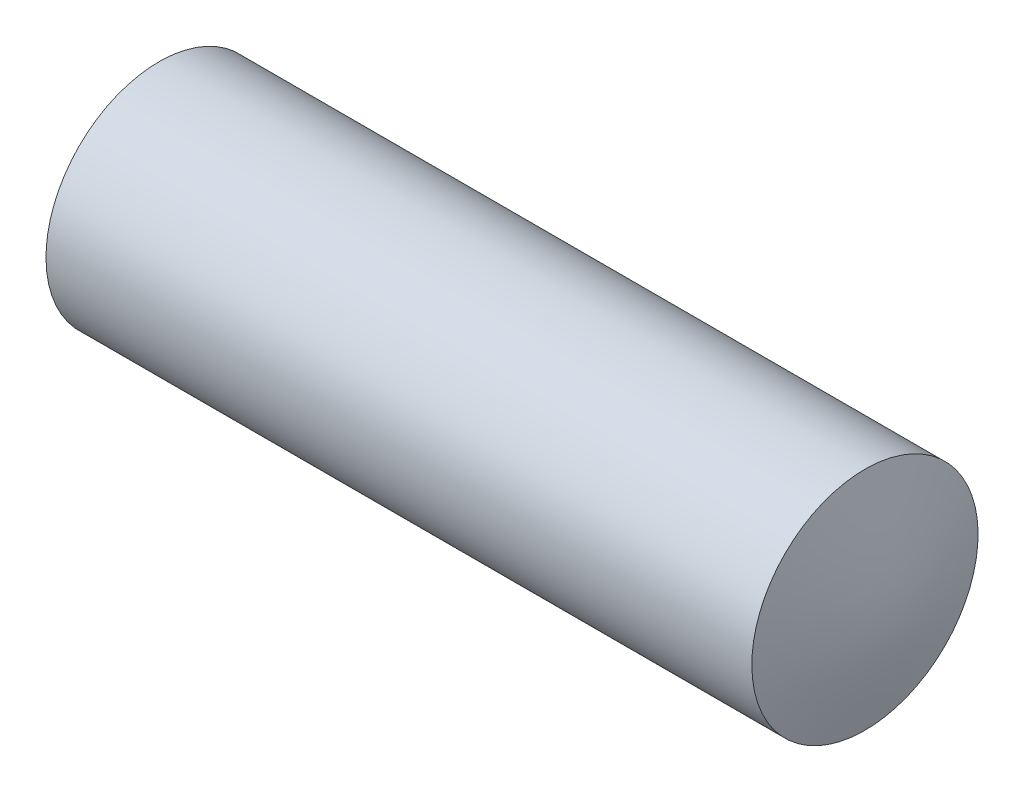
ISO-10303-21;
HEADER;
FILE_DESCRIPTION(('STEP AP214'),'2;1');
FILE_NAME('part.step','',(''),(''),'','','');
FILE_SCHEMA(('AUTOMOTIVE_DESIGN { 1 0 10303 214 1 1 1 1 }'));
ENDSEC;
DATA;
#1=APPLICATION_CONTEXT('core data for automotive mechanical design processes');
#2=APPLICATION_PROTOCOL_DEFINITION('international standard','automotive_design',2000,#1);
#3=PRODUCT_CONTEXT('',#1,'mechanical');
#4=PRODUCT('Part','Part','',(#3));
#5=PRODUCT_RELATED_PRODUCT_CATEGORY('part','',(#4));
#6=PRODUCT_DEFINITION_FORMATION('','',#4);
#7=PRODUCT_DEFINITION_CONTEXT('part definition',#1,'design');
#8=PRODUCT_DEFINITION('design','',#6,#7);
#9=PRODUCT_DEFINITION_SHAPE('','',#8);
#10=(LENGTH_UNIT() NAMED_UNIT(*) SI_UNIT(.MILLI.,.METRE.));
#11=(NAMED_UNIT(*) PLANE_ANGLE_UNIT() SI_UNIT($,.RADIAN.));
#12=(NAMED_UNIT(*) SI_UNIT($,.STERADIAN.) SOLID_ANGLE_UNIT());
#13=UNCERTAINTY_MEASURE_WITH_UNIT(LENGTH_MEASURE(1.E-05),#10,'distance_accuracy_value','');
#14=(GEOMETRIC_REPRESENTATION_CONTEXT(3) GLOBAL_UNCERTAINTY_ASSIGNED_CONTEXT((#13)) GLOBAL_UNIT_ASSIGNED_CONTEXT((#10,
#11,#12)) REPRESENTATION_CONTEXT('',''));
#15=CARTESIAN_POINT('',(0.,0.,0.));
#16=DIRECTION('',(0.,0.,1.));
#17=DIRECTION('',(1.,0.,0.));
#18=AXIS2_PLACEMENT_3D('',#15,#16,#17);
#19=CARTESIAN_POINT('',(1.9812,0.,0.));
#20=DIRECTION('',(-1.,0.,0.));
#21=DIRECTION('',(0.,0.,1.));
#22=AXIS2_PLACEMENT_3D('',#19,#20,#21);
#23=CYLINDRICAL_SURFACE('',#22,0.635);
#24=CARTESIAN_POINT('',(1.98130394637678,-9.15382352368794E-12,0.635));
#25=CARTESIAN_POINT('',(1.98130401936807,-0.0356682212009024,0.634998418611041));
#26=CARTESIAN_POINT('',(1.9813073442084,-0.0713623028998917,0.631984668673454));
#27=CARTESIAN_POINT('',(1.98130456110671,-0.141767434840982,0.620004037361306));
#28=CARTESIAN_POINT('',(1.9812984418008,-0.176477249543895,0.611029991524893));
#29=CARTESIAN_POINT('',(1.98130425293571,-0.243879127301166,0.587385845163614));
#30=CARTESIAN_POINT('',(1.98131617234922,-0.276572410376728,0.572719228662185));
#31=CARTESIAN_POINT('',(1.98134269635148,-0.339032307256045,0.538105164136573));
#32=CARTESIAN_POINT('',(1.98135730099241,-0.368798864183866,0.518157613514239));
#33=CARTESIAN_POINT('',(1.98137288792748,-0.424559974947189,0.473548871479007));
#34=CARTESIAN_POINT('',(1.98137387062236,-0.450554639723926,0.448887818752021));
#35=CARTESIAN_POINT('',(1.98136200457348,-0.498035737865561,0.395550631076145));
#36=CARTESIAN_POINT('',(1.98134915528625,-0.519521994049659,0.366874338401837));
#37=CARTESIAN_POINT('',(1.98132331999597,-0.557374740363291,0.306322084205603));
#38=CARTESIAN_POINT('',(1.98131033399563,-0.573741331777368,0.27444618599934));
#39=CARTESIAN_POINT('',(1.98130829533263,-0.600890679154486,0.208399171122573));
#40=CARTESIAN_POINT('',(1.9813192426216,-0.611673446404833,0.174228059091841));
#41=CARTESIAN_POINT('',(1.98133768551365,-0.627349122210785,0.104560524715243));
#42=CARTESIAN_POINT('',(1.98134518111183,-0.632242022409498,0.06906410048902));
#43=CARTESIAN_POINT('',(1.98135200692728,-0.635999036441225,-0.00224631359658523));
#44=CARTESIAN_POINT('',(1.9813513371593,-0.634863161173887,-0.038060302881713));
#45=CARTESIAN_POINT('',(1.98133704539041,-0.626594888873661,-0.108989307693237));
#46=CARTESIAN_POINT('',(1.98132342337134,-0.619462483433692,-0.144104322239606));
#47=CARTESIAN_POINT('',(1.9813088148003,-0.599403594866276,-0.212638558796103));
#48=CARTESIAN_POINT('',(1.98130782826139,-0.586477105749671,-0.246057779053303));
#49=CARTESIAN_POINT('',(1.98132257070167,-0.55519700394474,-0.310251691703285));
#50=CARTESIAN_POINT('',(1.98133829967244,-0.536843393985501,-0.341026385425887));
#51=CARTESIAN_POINT('',(1.98136258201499,-0.49523005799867,-0.399057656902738));
#52=CARTESIAN_POINT('',(1.98137113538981,-0.471970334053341,-0.426314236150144));
#53=CARTESIAN_POINT('',(1.98137282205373,-0.421205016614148,-0.476535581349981));
#54=CARTESIAN_POINT('',(1.98136595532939,-0.393699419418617,-0.499500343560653));
#55=CARTESIAN_POINT('',(1.98134234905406,-0.33522317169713,-0.540486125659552));
#56=CARTESIAN_POINT('',(1.9813256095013,-0.304252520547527,-0.558507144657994));
#57=CARTESIAN_POINT('',(1.98130506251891,-0.239725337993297,-0.589093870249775));
#58=CARTESIAN_POINT('',(1.98130125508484,-0.206168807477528,-0.601659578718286));
#59=CARTESIAN_POINT('',(1.98130097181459,-0.137422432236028,-0.620978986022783));
#60=CARTESIAN_POINT('',(1.98130449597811,-0.102232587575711,-0.627732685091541));
#61=CARTESIAN_POINT('',(1.98130665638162,-0.0312185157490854,-0.635236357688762));
#62=CARTESIAN_POINT('',(1.98130529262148,0.00460571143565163,-0.635986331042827));
#63=CARTESIAN_POINT('',(1.98130403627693,0.0758716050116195,-0.631461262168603));
#64=CARTESIAN_POINT('',(1.98130414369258,0.111313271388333,-0.626186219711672));
#65=CARTESIAN_POINT('',(1.98130242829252,0.180807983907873,-0.609760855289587));
#66=CARTESIAN_POINT('',(1.98130060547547,0.21486102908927,-0.598610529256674));
#67=CARTESIAN_POINT('',(1.98131507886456,0.280611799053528,-0.570751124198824));
#68=CARTESIAN_POINT('',(1.98133137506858,0.312309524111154,-0.554042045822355));
#69=CARTESIAN_POINT('',(1.9813580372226,0.372449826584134,-0.515539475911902));
#70=CARTESIAN_POINT('',(1.98136840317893,0.400892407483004,-0.493745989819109));
#71=CARTESIAN_POINT('',(1.981373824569,0.453715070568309,-0.445693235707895));
#72=CARTESIAN_POINT('',(1.98136887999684,0.478095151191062,-0.419433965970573));
#73=CARTESIAN_POINT('',(1.98134853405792,0.522100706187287,-0.363195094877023));
#74=CARTESIAN_POINT('',(1.9813331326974,0.54172618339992,-0.333215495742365));
#75=CARTESIAN_POINT('',(1.98131201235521,0.575665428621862,-0.270387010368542));
#76=CARTESIAN_POINT('',(1.98130629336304,0.589979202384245,-0.237538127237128));
#77=CARTESIAN_POINT('',(1.98131562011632,0.612888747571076,-0.16990351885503));
#78=CARTESIAN_POINT('',(1.9813306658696,0.621484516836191,-0.135117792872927));
#79=CARTESIAN_POINT('',(1.98134801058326,0.632714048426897,-0.0645969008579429));
#80=CARTESIAN_POINT('',(1.98135030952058,0.635347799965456,-0.0288617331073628));
#81=CARTESIAN_POINT('',(1.98134885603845,0.634578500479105,0.0425435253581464));
#82=CARTESIAN_POINT('',(1.98134510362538,0.631175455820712,0.0782136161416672));
#83=CARTESIAN_POINT('',(1.98132677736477,0.618429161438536,0.148476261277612));
#84=CARTESIAN_POINT('',(1.98131220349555,0.609085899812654,0.183068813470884));
#85=CARTESIAN_POINT('',(1.9813063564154,0.584724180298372,0.250194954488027));
#86=CARTESIAN_POINT('',(1.98131508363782,0.569705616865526,0.282728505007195));
#87=CARTESIAN_POINT('',(1.98133865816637,0.534420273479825,0.344811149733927));
#88=CARTESIAN_POINT('',(1.98135350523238,0.514153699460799,0.374360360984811));
#89=CARTESIAN_POINT('',(1.98137136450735,0.468947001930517,0.429637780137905));
#90=CARTESIAN_POINT('',(1.98137437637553,0.444006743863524,0.455365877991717));
#91=CARTESIAN_POINT('',(1.9813653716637,0.390160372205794,0.502269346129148));
#92=CARTESIAN_POINT('',(1.98135335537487,0.361254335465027,0.523444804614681));
#93=CARTESIAN_POINT('',(1.98132607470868,0.300282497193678,0.560653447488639));
#94=CARTESIAN_POINT('',(1.98131080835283,0.268214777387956,0.576683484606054));
#95=CARTESIAN_POINT('',(1.98129921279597,0.201868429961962,0.603113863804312));
#96=CARTESIAN_POINT('',(1.98130286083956,0.167592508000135,0.613520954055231));
#97=CARTESIAN_POINT('',(1.98130567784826,0.110915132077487,0.625636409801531));
#98=CARTESIAN_POINT('',(1.98130601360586,0.0888819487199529,0.629143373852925));
#99=CARTESIAN_POINT('',(1.9813051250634,0.0445692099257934,0.633825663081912));
#100=CARTESIAN_POINT('',(1.98130390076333,0.0222896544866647,0.635000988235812));
#101=CARTESIAN_POINT('',(1.98130394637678,-9.15382352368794E-12,0.635));
#102=B_SPLINE_CURVE_WITH_KNOTS('',3,(#24,#25,#26,#27,#28,#29,#30,#31,#32,#33,#34,#35,#36,#37,
#38,#39,#40,#41,#42,#43,#44,#45,#46,#47,#48,#49,#50,#51,#52,#53,#54,#55,#56,#57,#58,#59,#60,#61,
#62,#63,#64,#65,#66,#67,#68,#69,#70,#71,#72,#73,#74,#75,#76,#77,#78,#79,#80,#81,#82,#83,#84,#85,
#86,#87,#88,#89,#90,#91,#92,#93,#94,#95,#96,#97,#98,#99,#100,#101),.UNSPECIFIED.,.T.,.F.,(4,2,2,
2,2,2,2,2,2,2,2,2,2,2,2,2,2,2,2,2,2,2,2,2,2,2,2,2,2,2,2,2,2,2,2,2,2,2,4),(0.,0.106923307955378,
0.213975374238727,0.320962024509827,0.427950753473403,0.534936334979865,0.641926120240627,
0.748913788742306,0.855901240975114,0.962888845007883,1.06987625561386,1.17686381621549,
1.28385148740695,1.39083910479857,1.49782667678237,1.60481434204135,1.71180202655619,
1.81878967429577,1.92577731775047,2.03276496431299,2.13975261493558,2.24674033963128,
2.3537280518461,2.46071564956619,2.56770328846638,2.67469086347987,2.78167832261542,
2.88866582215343,2.99565351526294,3.10264109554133,3.20962889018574,3.31661867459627,
3.42360426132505,3.53059292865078,3.63757952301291,3.74463143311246,3.85155458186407,
3.91837270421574,3.98519082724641),.UNSPECIFIED.);
#103=CARTESIAN_POINT('',(1.98130394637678,-9.15382352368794E-12,0.635));
#104=VERTEX_POINT('',#103);
#105=EDGE_CURVE('E12',#104,#104,#102,.T.);
#106=ORIENTED_EDGE('',*,*,#105,.F.);
#107=EDGE_LOOP('',(#106));
#108=FACE_BOUND('',#107,.T.);
#109=CARTESIAN_POINT('',(-1.98130394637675,9.37370705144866E-12,0.635));
#110=CARTESIAN_POINT('',(-1.98130402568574,-0.0356682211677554,0.634998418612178));
#111=CARTESIAN_POINT('',(-1.98130735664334,-0.0713623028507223,0.631984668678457));
#112=CARTESIAN_POINT('',(-1.98130459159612,-0.14176743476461,0.620004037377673));
#113=CARTESIAN_POINT('',(-1.9812984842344,-0.176477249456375,0.611029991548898));
#114=CARTESIAN_POINT('',(-1.98130433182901,-0.243879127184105,0.587385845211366));
#115=CARTESIAN_POINT('',(-1.98131627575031,-0.276572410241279,0.572719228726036));
#116=CARTESIAN_POINT('',(-1.98134284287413,-0.339032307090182,0.538105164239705));
#117=CARTESIAN_POINT('',(-1.98135746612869,-0.368798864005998,0.518157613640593));
#118=CARTESIAN_POINT('',(-1.98137305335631,-0.424559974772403,0.473548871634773));
#119=CARTESIAN_POINT('',(-1.98137401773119,-0.450554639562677,0.448887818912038));
#120=CARTESIAN_POINT('',(-1.98136207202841,-0.498035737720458,0.395550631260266));
#121=CARTESIAN_POINT('',(-1.98134916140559,-0.519521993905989,0.366874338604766));
#122=CARTESIAN_POINT('',(-1.98132320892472,-0.557374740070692,0.306322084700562));
#123=CARTESIAN_POINT('',(-1.98131016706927,-0.573741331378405,0.274446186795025));
#124=CARTESIAN_POINT('',(-1.98130808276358,-0.600890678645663,0.208399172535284));
#125=CARTESIAN_POINT('',(-1.98131904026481,-0.611673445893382,0.174228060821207));
#126=CARTESIAN_POINT('',(-1.98133754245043,-0.627349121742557,0.104560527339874));
#127=CARTESIAN_POINT('',(-1.98134508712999,-0.632242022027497,0.0690641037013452));
#128=CARTESIAN_POINT('',(-1.98135201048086,-0.635999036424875,-0.00224630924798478));
#129=CARTESIAN_POINT('',(-1.98135138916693,-0.634863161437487,-0.0380602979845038));
#130=CARTESIAN_POINT('',(-1.98133718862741,-0.626594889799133,-0.108989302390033));
#131=CARTESIAN_POINT('',(-1.98132360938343,-0.619462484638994,-0.144104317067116));
#132=CARTESIAN_POINT('',(-1.98130902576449,-0.599403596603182,-0.212638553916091));
#133=CARTESIAN_POINT('',(-1.98130802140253,-0.58647710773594,-0.246057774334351));
#134=CARTESIAN_POINT('',(-1.98132268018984,-0.555197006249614,-0.310251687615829));
#135=CARTESIAN_POINT('',(-1.98133834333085,-0.536843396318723,-0.341026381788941));
#136=CARTESIAN_POINT('',(-1.98136251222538,-0.495230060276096,-0.399057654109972));
#137=CARTESIAN_POINT('',(-1.98137101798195,-0.471970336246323,-0.426314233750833));
#138=CARTESIAN_POINT('',(-1.98137265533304,-0.421205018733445,-0.476535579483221));
#139=CARTESIAN_POINT('',(-1.98136578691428,-0.393699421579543,-0.499500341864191));
#140=CARTESIAN_POINT('',(-1.9813422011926,-0.335223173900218,-0.540486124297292));
#141=CARTESIAN_POINT('',(-1.98132548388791,-0.304252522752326,-0.558507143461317));
#142=CARTESIAN_POINT('',(-1.98130497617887,-0.239725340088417,-0.589093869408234));
#143=CARTESIAN_POINT('',(-1.98130118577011,-0.206168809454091,-0.60165957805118));
#144=CARTESIAN_POINT('',(-1.98130092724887,-0.137422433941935,-0.620978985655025));
#145=CARTESIAN_POINT('',(-1.98130445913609,-0.102232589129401,-0.627732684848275));
#146=CARTESIAN_POINT('',(-1.98130664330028,-0.0312185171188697,-0.635236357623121));
#147=CARTESIAN_POINT('',(-1.98130529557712,0.00460571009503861,-0.635986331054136));
#148=CARTESIAN_POINT('',(-1.98130406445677,0.075871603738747,-0.631461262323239));
#149=CARTESIAN_POINT('',(-1.98130418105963,0.111313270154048,-0.626186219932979));
#150=CARTESIAN_POINT('',(-1.98130248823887,0.180807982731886,-0.60976085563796));
#151=CARTESIAN_POINT('',(-1.98130067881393,0.214861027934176,-0.598610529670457));
#152=CARTESIAN_POINT('',(-1.98131518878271,0.28061179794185,-0.5707511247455));
#153=CARTESIAN_POINT('',(-1.98133150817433,0.312309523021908,-0.554042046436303));
#154=CARTESIAN_POINT('',(-1.9813582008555,0.372449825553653,-0.515539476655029));
#155=CARTESIAN_POINT('',(-1.98136857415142,0.4008924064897,-0.493745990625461));
#156=CARTESIAN_POINT('',(-1.98137396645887,0.453715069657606,-0.445693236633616));
#157=CARTESIAN_POINT('',(-1.98136898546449,0.478095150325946,-0.419433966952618));
#158=CARTESIAN_POINT('',(-1.9813485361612,0.522100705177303,-0.363195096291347));
#159=CARTESIAN_POINT('',(-1.98133306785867,0.541726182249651,-0.333215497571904));
#160=CARTESIAN_POINT('',(-1.98131184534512,0.575665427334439,-0.270387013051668));
#161=CARTESIAN_POINT('',(-1.98130609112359,0.589979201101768,-0.237538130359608));
#162=CARTESIAN_POINT('',(-1.98131541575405,0.612888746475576,-0.169903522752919));
#163=CARTESIAN_POINT('',(-1.98133049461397,0.621484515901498,-0.135117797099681));
#164=CARTESIAN_POINT('',(-1.9813479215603,0.632714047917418,-0.064596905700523));
#165=CARTESIAN_POINT('',(-1.98135026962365,0.635347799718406,-0.0288617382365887));
#166=CARTESIAN_POINT('',(-1.98134891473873,0.634578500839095,0.0425435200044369));
#167=CARTESIAN_POINT('',(-1.98134521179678,0.631175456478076,0.0782136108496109));
#168=CARTESIAN_POINT('',(-1.9813269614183,0.618429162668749,0.148476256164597));
#169=CARTESIAN_POINT('',(-1.98131241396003,0.609085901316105,0.183068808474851));
#170=CARTESIAN_POINT('',(-1.98130654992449,0.584724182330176,0.250194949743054));
#171=CARTESIAN_POINT('',(-1.98131523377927,0.569705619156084,0.282728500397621));
#172=CARTESIAN_POINT('',(-1.98133869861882,0.534420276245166,0.344811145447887));
#173=CARTESIAN_POINT('',(-1.98135347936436,0.514153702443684,0.374360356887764));
#174=CARTESIAN_POINT('',(-1.9813712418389,0.468947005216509,0.429637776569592));
#175=CARTESIAN_POINT('',(-1.98137422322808,0.444006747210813,0.455365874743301));
#176=CARTESIAN_POINT('',(-1.98136520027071,0.390160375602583,0.502269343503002));
#177=CARTESIAN_POINT('',(-1.98135319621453,0.361254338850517,0.523444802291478));
#178=CARTESIAN_POINT('',(-1.98132595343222,0.300282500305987,0.560653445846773));
#179=CARTESIAN_POINT('',(-1.98131071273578,0.268214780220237,0.576683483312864));
#180=CARTESIAN_POINT('',(-1.98129915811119,0.201868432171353,0.603113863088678));
#181=CARTESIAN_POINT('',(-1.9813028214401,0.167592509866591,0.613520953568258));
#182=CARTESIAN_POINT('',(-1.98130565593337,0.110915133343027,0.625636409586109));
#183=CARTESIAN_POINT('',(-1.98130599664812,0.0888819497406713,0.629143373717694));
#184=CARTESIAN_POINT('',(-1.98130511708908,0.0445692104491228,0.633825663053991));
#185=CARTESIAN_POINT('',(-1.98130389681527,0.0222896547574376,0.635000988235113));
#186=CARTESIAN_POINT('',(-1.98130394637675,9.37370705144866E-12,0.635));
#187=B_SPLINE_CURVE_WITH_KNOTS('',3,(#109,#110,#111,#112,#113,#114,#115,#116,#117,#118,#119,
#120,#121,#122,#123,#124,#125,#126,#127,#128,#129,#130,#131,#132,#133,#134,#135,#136,#137,#138,
#139,#140,#141,#142,#143,#144,#145,#146,#147,#148,#149,#150,#151,#152,#153,#154,#155,#156,#157,
#158,#159,#160,#161,#162,#163,#164,#165,#166,#167,#168,#169,#170,#171,#172,#173,#174,#175,#176,
#177,#178,#179,#180,#181,#182,#183,#184,#185,#186),.UNSPECIFIED.,.T.,.F.,(4,2,2,2,2,2,2,2,2,2,2,
2,2,2,2,2,2,2,2,2,2,2,2,2,2,2,2,2,2,2,2,2,2,2,2,2,2,2,4),(0.,0.106923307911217,
0.213975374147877,0.320962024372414,0.427950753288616,0.534936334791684,0.641926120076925,
0.748913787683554,0.85590123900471,0.962888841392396,1.06987625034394,1.1768638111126,
1.28385148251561,1.39083910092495,1.49782667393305,1.60481433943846,1.71180202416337,
1.81878967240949,1.9257773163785,2.03276496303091,2.13975261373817,2.24674033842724,
2.35372805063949,2.46071564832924,2.5677032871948,2.67469086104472,2.78167831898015,
2.88866581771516,2.99565351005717,3.10264109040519,3.20962888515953,3.31661866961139,
3.4236042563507,3.53059292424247,3.63757951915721,3.74463143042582,3.85155458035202,
3.91837270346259,3.98519082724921),.UNSPECIFIED.);
#188=CARTESIAN_POINT('',(-1.98130394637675,9.37370705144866E-12,0.635));
#189=VERTEX_POINT('',#188);
#190=EDGE_CURVE('E107',#189,#189,#187,.T.);
#191=ORIENTED_EDGE('',*,*,#190,.T.);
#192=EDGE_LOOP('',(#191));
#193=FACE_BOUND('',#192,.T.);
#194=ADVANCED_FACE('F93',(#108,#193),#23,.T.);
#195=CARTESIAN_POINT('',(1.90470940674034,-0.647693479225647,-0.675908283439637));
#196=CARTESIAN_POINT('',(1.9231643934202,-0.647693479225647,-0.56776322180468));
#197=CARTESIAN_POINT('',(1.93994511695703,-0.647693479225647,-0.459618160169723));
#198=CARTESIAN_POINT('',(1.9555573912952,-0.647693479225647,-0.351473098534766));
#199=CARTESIAN_POINT('',(1.97354865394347,-0.647693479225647,-0.189255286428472));
#200=CARTESIAN_POINT('',(1.97854036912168,-0.647693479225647,-0.0270374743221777));
#201=CARTESIAN_POINT('',(1.97854042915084,-0.647693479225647,0.0270352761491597));
#202=CARTESIAN_POINT('',(1.97354911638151,-0.647693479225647,0.189253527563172));
#203=CARTESIAN_POINT('',(1.95555799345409,-0.647693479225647,0.351471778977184));
#204=CARTESIAN_POINT('',(1.93994517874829,-0.647693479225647,0.459617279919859));
#205=CARTESIAN_POINT('',(1.92316418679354,-0.647693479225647,0.567762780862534));
#206=CARTESIAN_POINT('',(1.90470896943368,-0.647693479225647,0.675908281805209));
#207=CARTESIAN_POINT('',(1.92117750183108,-0.54406277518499,-0.675908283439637));
#208=CARTESIAN_POINT('',(1.94255039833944,-0.54406277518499,-0.56776322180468));
#209=CARTESIAN_POINT('',(1.96222534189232,-0.54406277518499,-0.459618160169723));
#210=CARTESIAN_POINT('',(1.98084922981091,-0.54406277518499,-0.351473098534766));
#211=CARTESIAN_POINT('',(2.00240200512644,-0.54406277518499,-0.189255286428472));
#212=CARTESIAN_POINT('',(2.00838214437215,-0.54406277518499,-0.0270374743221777));
#213=CARTESIAN_POINT('',(2.00838220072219,-0.54406277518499,0.0270352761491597));
#214=CARTESIAN_POINT('',(2.00240238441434,-0.54406277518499,0.189253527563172));
#215=CARTESIAN_POINT('',(1.98084961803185,-0.54406277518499,0.351471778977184));
#216=CARTESIAN_POINT('',(1.96222523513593,-0.54406277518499,0.459617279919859));
#217=CARTESIAN_POINT('',(1.94255012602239,-0.54406277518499,0.567762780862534));
#218=CARTESIAN_POINT('',(1.92117706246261,-0.54406277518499,0.675908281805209));
#219=CARTESIAN_POINT('',(1.93610574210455,-0.440432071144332,-0.675908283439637));
#220=CARTESIAN_POINT('',(1.96037452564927,-0.440432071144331,-0.56776322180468));
#221=CARTESIAN_POINT('',(1.9828982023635,-0.440432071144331,-0.459618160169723));
#222=CARTESIAN_POINT('',(2.00464668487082,-0.440432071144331,-0.351473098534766));
#223=CARTESIAN_POINT('',(2.02988323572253,-0.440432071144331,-0.189255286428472));
#224=CARTESIAN_POINT('',(2.03688482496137,-0.440432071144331,-0.0270374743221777));
#225=CARTESIAN_POINT('',(2.0368848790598,-0.440432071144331,0.0270352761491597));
#226=CARTESIAN_POINT('',(2.02988357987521,-0.440432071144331,0.189253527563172));
#227=CARTESIAN_POINT('',(2.00464683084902,-0.440432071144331,0.351471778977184));
#228=CARTESIAN_POINT('',(1.9828980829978,-0.440432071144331,0.459617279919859));
#229=CARTESIAN_POINT('',(1.96037431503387,-0.440432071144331,0.567762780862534));
#230=CARTESIAN_POINT('',(1.93610541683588,-0.440432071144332,0.675908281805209));
#231=CARTESIAN_POINT('',(1.94993954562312,-0.336801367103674,-0.675908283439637));
#232=CARTESIAN_POINT('',(1.97722960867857,-0.336801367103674,-0.56776322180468));
#233=CARTESIAN_POINT('',(2.00286507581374,-0.336801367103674,-0.459618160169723));
#234=CARTESIAN_POINT('',(2.02804066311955,-0.336801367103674,-0.351473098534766));
#235=CARTESIAN_POINT('',(2.0567550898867,-0.336801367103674,-0.189255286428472));
#236=CARTESIAN_POINT('',(2.06481217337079,-0.336801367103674,-0.0270374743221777));
#237=CARTESIAN_POINT('',(2.06481222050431,-0.336801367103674,0.0270352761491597));
#238=CARTESIAN_POINT('',(2.05675533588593,-0.336801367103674,0.189253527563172));
#239=CARTESIAN_POINT('',(2.02804088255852,-0.336801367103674,0.351471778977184));
#240=CARTESIAN_POINT('',(2.00286521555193,-0.336801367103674,0.459617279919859));
#241=CARTESIAN_POINT('',(1.97722960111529,-0.336801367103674,0.567762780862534));
#242=CARTESIAN_POINT('',(1.94993943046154,-0.336801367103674,0.675908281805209));
#243=CARTESIAN_POINT('',(1.96573643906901,-0.181355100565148,-0.675908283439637));
#244=CARTESIAN_POINT('',(1.99665606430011,-0.181355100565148,-0.56776322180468));
#245=CARTESIAN_POINT('',(2.02606426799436,-0.181355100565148,-0.459618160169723));
#246=CARTESIAN_POINT('',(2.05477204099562,-0.181355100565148,-0.351473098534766));
#247=CARTESIAN_POINT('',(2.09011780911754,-0.181355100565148,-0.189255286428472));
#248=CARTESIAN_POINT('',(2.10019283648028,-0.181355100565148,-0.0270374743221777));
#249=CARTESIAN_POINT('',(2.10019288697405,-0.181355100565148,0.0270352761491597));
#250=CARTESIAN_POINT('',(2.09011813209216,-0.181355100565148,0.189253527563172));
#251=CARTESIAN_POINT('',(2.05477237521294,-0.181355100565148,0.351471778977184));
#252=CARTESIAN_POINT('',(2.02606445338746,-0.181355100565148,0.459617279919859));
#253=CARTESIAN_POINT('',(1.99665614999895,-0.181355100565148,0.567762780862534));
#254=CARTESIAN_POINT('',(1.96573639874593,-0.181355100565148,0.675908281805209));
#255=CARTESIAN_POINT('',(1.97007920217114,-0.0259088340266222,-0.675908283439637));
#256=CARTESIAN_POINT('',(2.00201983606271,-0.0259088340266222,-0.56776322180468));
#257=CARTESIAN_POINT('',(2.03250049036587,-0.0259088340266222,-0.459618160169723));
#258=CARTESIAN_POINT('',(2.06228741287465,-0.0259088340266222,-0.351473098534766));
#259=CARTESIAN_POINT('',(2.09965770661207,-0.0259088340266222,-0.189255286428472));
#260=CARTESIAN_POINT('',(2.1112209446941,-0.0259088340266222,-0.0270374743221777));
#261=CARTESIAN_POINT('',(2.11122101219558,-0.0259088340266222,0.0270352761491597));
#262=CARTESIAN_POINT('',(2.09965807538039,-0.0259088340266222,0.189253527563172));
#263=CARTESIAN_POINT('',(2.06228777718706,-0.0259088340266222,0.351471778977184));
#264=CARTESIAN_POINT('',(2.0325007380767,-0.0259088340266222,0.459617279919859));
#265=CARTESIAN_POINT('',(2.00201995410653,-0.0259088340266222,0.567762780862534));
#266=CARTESIAN_POINT('',(1.97007919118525,-0.0259088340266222,0.675908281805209));
#267=CARTESIAN_POINT('',(1.97007920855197,0.0259067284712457,-0.675908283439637));
#268=CARTESIAN_POINT('',(2.00201985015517,0.0259067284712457,-0.56776322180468));
#269=CARTESIAN_POINT('',(2.03250052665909,0.0259067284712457,-0.459618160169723));
#270=CARTESIAN_POINT('',(2.06228744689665,0.0259067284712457,-0.351473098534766));
#271=CARTESIAN_POINT('',(2.09965775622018,0.0259067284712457,-0.189255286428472));
#272=CARTESIAN_POINT('',(2.1112210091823,0.0259067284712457,-0.0270374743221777));
#273=CARTESIAN_POINT('',(2.11122107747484,0.0259067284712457,0.0270352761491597));
#274=CARTESIAN_POINT('',(2.09965812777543,0.0259067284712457,0.189253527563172));
#275=CARTESIAN_POINT('',(2.06228782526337,0.0259067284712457,0.351471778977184));
#276=CARTESIAN_POINT('',(2.03250077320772,0.0259067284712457,0.459617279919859));
#277=CARTESIAN_POINT('',(2.00201999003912,0.0259067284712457,0.567762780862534));
#278=CARTESIAN_POINT('',(1.97007921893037,0.0259067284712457,0.675908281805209));
#279=CARTESIAN_POINT('',(1.96573652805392,0.18135341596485,-0.675908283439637));
#280=CARTESIAN_POINT('',(1.99665619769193,0.18135341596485,-0.56776322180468));
#281=CARTESIAN_POINT('',(2.02606443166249,0.18135341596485,-0.459618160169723));
#282=CARTESIAN_POINT('',(2.05477226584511,0.18135341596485,-0.351473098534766));
#283=CARTESIAN_POINT('',(2.09011811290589,0.18135341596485,-0.189255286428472));
#284=CARTESIAN_POINT('',(2.10019318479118,0.18135341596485,-0.0270374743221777));
#285=CARTESIAN_POINT('',(2.10019324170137,0.18135341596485,0.0270352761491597));
#286=CARTESIAN_POINT('',(2.09011847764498,0.18135341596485,0.189253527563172));
#287=CARTESIAN_POINT('',(2.05477265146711,0.18135341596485,0.351471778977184));
#288=CARTESIAN_POINT('',(2.02606472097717,0.18135341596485,0.459617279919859));
#289=CARTESIAN_POINT('',(1.99665636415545,0.18135341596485,0.567762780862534));
#290=CARTESIAN_POINT('',(1.96573657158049,0.18135341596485,0.675908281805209));
#291=CARTESIAN_POINT('',(1.94993959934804,0.336800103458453,-0.675908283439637));
#292=CARTESIAN_POINT('',(1.97722970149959,0.336800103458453,-0.56776322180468));
#293=CARTESIAN_POINT('',(2.00286525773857,0.336800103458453,-0.459618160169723));
#294=CARTESIAN_POINT('',(2.02804085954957,0.336800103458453,-0.351473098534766));
#295=CARTESIAN_POINT('',(2.05675540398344,0.336800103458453,-0.189255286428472));
#296=CARTESIAN_POINT('',(2.06481252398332,0.336800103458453,-0.0270374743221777));
#297=CARTESIAN_POINT('',(2.06481256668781,0.336800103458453,0.0270352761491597));
#298=CARTESIAN_POINT('',(2.05675569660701,0.336800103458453,0.189253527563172));
#299=CARTESIAN_POINT('',(2.02804126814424,0.336800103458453,0.351471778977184));
#300=CARTESIAN_POINT('',(2.00286553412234,0.336800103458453,0.459617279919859));
#301=CARTESIAN_POINT('',(1.97722993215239,0.336800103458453,0.567762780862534));
#302=CARTESIAN_POINT('',(1.94993971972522,0.336800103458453,0.675908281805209));
#303=CARTESIAN_POINT('',(1.93610553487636,0.440431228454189,-0.675908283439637));
#304=CARTESIAN_POINT('',(1.96037436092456,0.440431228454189,-0.56776322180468));
#305=CARTESIAN_POINT('',(1.98289806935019,0.440431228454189,-0.459618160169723));
#306=CARTESIAN_POINT('',(2.00464675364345,0.440431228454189,-0.351473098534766));
#307=CARTESIAN_POINT('',(2.02988356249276,0.440431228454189,-0.189255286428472));
#308=CARTESIAN_POINT('',(2.03688507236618,0.440431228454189,-0.0270374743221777));
#309=CARTESIAN_POINT('',(2.03688509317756,0.440431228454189,0.0270352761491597));
#310=CARTESIAN_POINT('',(2.02988369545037,0.440431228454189,0.189253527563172));
#311=CARTESIAN_POINT('',(2.0046471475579,0.440431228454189,0.351471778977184));
#312=CARTESIAN_POINT('',(1.98289855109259,0.440431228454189,0.459617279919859));
#313=CARTESIAN_POINT('',(1.96037476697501,0.440431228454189,0.567762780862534));
#314=CARTESIAN_POINT('',(1.93610586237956,0.440431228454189,0.675908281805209));
#315=CARTESIAN_POINT('',(1.92117712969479,0.544062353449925,-0.675908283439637));
#316=CARTESIAN_POINT('',(1.94255012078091,0.544062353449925,-0.56776322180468));
#317=CARTESIAN_POINT('',(1.96222516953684,0.544062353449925,-0.459618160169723));
#318=CARTESIAN_POINT('',(1.98084948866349,0.544062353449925,-0.351473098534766));
#319=CARTESIAN_POINT('',(2.00240229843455,0.544062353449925,-0.189255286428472));
#320=CARTESIAN_POINT('',(2.00838228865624,0.544062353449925,-0.0270374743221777));
#321=CARTESIAN_POINT('',(2.00838229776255,0.544062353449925,0.0270352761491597));
#322=CARTESIAN_POINT('',(2.00240232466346,0.544062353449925,0.189253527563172));
#323=CARTESIAN_POINT('',(1.98084956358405,0.544062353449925,0.351471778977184));
#324=CARTESIAN_POINT('',(1.96222558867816,0.544062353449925,0.459617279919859));
#325=CARTESIAN_POINT('',(1.94255056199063,0.544062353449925,0.567762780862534));
#326=CARTESIAN_POINT('',(1.92117756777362,0.544062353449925,0.675908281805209));
#327=CARTESIAN_POINT('',(1.90470897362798,0.647693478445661,-0.675908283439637));
#328=CARTESIAN_POINT('',(1.92316411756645,0.647693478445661,-0.56776322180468));
#329=CARTESIAN_POINT('',(1.93994504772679,0.647693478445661,-0.459618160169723));
#330=CARTESIAN_POINT('',(1.95555780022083,0.647693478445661,-0.351473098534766));
#331=CARTESIAN_POINT('',(1.97354894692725,0.647693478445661,-0.189255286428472));
#332=CARTESIAN_POINT('',(1.97854040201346,0.647693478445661,-0.0270374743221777));
#333=CARTESIAN_POINT('',(1.97854039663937,0.647693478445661,0.0270352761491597));
#334=CARTESIAN_POINT('',(1.97354882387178,0.647693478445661,0.189253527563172));
#335=CARTESIAN_POINT('',(1.95555758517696,0.647693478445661,0.351471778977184));
#336=CARTESIAN_POINT('',(1.93994524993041,0.647693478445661,0.459617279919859));
#337=CARTESIAN_POINT('',(1.9231644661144,0.647693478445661,0.567762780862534));
#338=CARTESIAN_POINT('',(1.90470940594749,0.647693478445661,0.675908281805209));
#339=B_SPLINE_SURFACE_WITH_KNOTS('',5,5,((#195,#196,#197,#198,#199,#200,#201,#202,#203,#204,
#205,#206),(#207,#208,#209,#210,#211,#212,#213,#214,#215,#216,#217,#218),(#219,#220,#221,#222,
#223,#224,#225,#226,#227,#228,#229,#230),(#231,#232,#233,#234,#235,#236,#237,#238,#239,#240,
#241,#242),(#243,#244,#245,#246,#247,#248,#249,#250,#251,#252,#253,#254),(#255,#256,#257,#258,
#259,#260,#261,#262,#263,#264,#265,#266),(#267,#268,#269,#270,#271,#272,#273,#274,#275,#276,
#277,#278),(#279,#280,#281,#282,#283,#284,#285,#286,#287,#288,#289,#290),(#291,#292,#293,#294,
#295,#296,#297,#298,#299,#300,#301,#302),(#303,#304,#305,#306,#307,#308,#309,#310,#311,#312,
#313,#314),(#315,#316,#317,#318,#319,#320,#321,#322,#323,#324,#325,#326),(#327,#328,#329,#330,
#331,#332,#333,#334,#335,#336,#337,#338)),.UNSPECIFIED.,.F.,.F.,.F.,(6,3,3,6),(6,3,3,6),
(-0.647693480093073,-0.129539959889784,0.129537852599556,0.647693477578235),(-0.675908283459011,
-0.135182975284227,0.135180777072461,0.675908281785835),.UNSPECIFIED.);
#340=ORIENTED_EDGE('',*,*,#105,.T.);
#341=EDGE_LOOP('',(#340));
#342=FACE_BOUND('',#341,.T.);
#343=ADVANCED_FACE('F95',(#342),#339,.T.);
#344=CARTESIAN_POINT('',(-1.90470897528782,-0.647693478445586,-0.675908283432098));
#345=CARTESIAN_POINT('',(-1.92316411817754,-0.647693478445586,-0.567763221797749));
#346=CARTESIAN_POINT('',(-1.93994504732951,-0.647693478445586,-0.459618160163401));
#347=CARTESIAN_POINT('',(-1.95555779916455,-0.647693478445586,-0.351473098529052));
#348=CARTESIAN_POINT('',(-1.9735489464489,-0.647693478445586,-0.18925528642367));
#349=CARTESIAN_POINT('',(-1.97854040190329,-0.647693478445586,-0.0270374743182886));
#350=CARTESIAN_POINT('',(-1.97854039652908,-0.647693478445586,0.0270352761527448));
#351=CARTESIAN_POINT('',(-1.97354882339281,-0.647693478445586,0.189253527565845));
#352=CARTESIAN_POINT('',(-1.95555758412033,-0.647693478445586,0.351471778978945));
#353=CARTESIAN_POINT('',(-1.93994524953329,-0.647693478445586,0.459617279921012));
#354=CARTESIAN_POINT('',(-1.92316446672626,-0.647693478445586,0.567762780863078));
#355=CARTESIAN_POINT('',(-1.904709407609,-0.647693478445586,0.675908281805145));
#356=CARTESIAN_POINT('',(-1.92117706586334,-0.544062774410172,-0.675908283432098));
#357=CARTESIAN_POINT('',(-1.94255004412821,-0.544062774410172,-0.567763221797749));
#358=CARTESIAN_POINT('',(-1.96222508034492,-0.544062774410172,-0.459618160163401));
#359=CARTESIAN_POINT('',(-1.98084938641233,-0.544062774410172,-0.351473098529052));
#360=CARTESIAN_POINT('',(-2.00240218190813,-0.544062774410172,-0.18925528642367));
#361=CARTESIAN_POINT('',(-2.00838216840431,-0.544062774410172,-0.0270374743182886));
#362=CARTESIAN_POINT('',(-2.00838217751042,-0.544062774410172,0.0270352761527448));
#363=CARTESIAN_POINT('',(-2.00240220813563,-0.544062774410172,0.189253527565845));
#364=CARTESIAN_POINT('',(-1.98084946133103,-0.544062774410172,0.351471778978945));
#365=CARTESIAN_POINT('',(-1.96222549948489,-0.544062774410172,0.459617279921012));
#366=CARTESIAN_POINT('',(-1.9425504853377,-0.544062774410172,0.567762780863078));
#367=CARTESIAN_POINT('',(-1.92117750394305,-0.544062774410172,0.675908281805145));
#368=CARTESIAN_POINT('',(-1.93610541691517,-0.440432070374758,-0.675908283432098));
#369=CARTESIAN_POINT('',(-1.96037421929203,-0.440432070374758,-0.567763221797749));
#370=CARTESIAN_POINT('',(-1.98289790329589,-0.440432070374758,-0.459618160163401));
#371=CARTESIAN_POINT('',(-2.00464656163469,-0.440432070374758,-0.351473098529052));
#372=CARTESIAN_POINT('',(-2.02988334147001,-0.440432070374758,-0.18925528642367));
#373=CARTESIAN_POINT('',(-2.0368848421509,-0.440432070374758,-0.0270374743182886));
#374=CARTESIAN_POINT('',(-2.03688486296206,-0.440432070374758,0.0270352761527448));
#375=CARTESIAN_POINT('',(-2.02988347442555,-0.440432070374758,0.189253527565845));
#376=CARTESIAN_POINT('',(-2.00464695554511,-0.440432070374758,0.351471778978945));
#377=CARTESIAN_POINT('',(-1.98289838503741,-0.440432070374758,0.459617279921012));
#378=CARTESIAN_POINT('',(-1.96037462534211,-0.440432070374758,0.567762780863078));
#379=CARTESIAN_POINT('',(-1.9361057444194,-0.440432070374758,0.675908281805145));
#380=CARTESIAN_POINT('',(-1.94993942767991,-0.336801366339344,-0.675908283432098));
#381=CARTESIAN_POINT('',(-1.97722949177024,-0.336801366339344,-0.567763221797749));
#382=CARTESIAN_POINT('',(-2.00286500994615,-0.336801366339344,-0.459618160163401));
#383=CARTESIAN_POINT('',(-2.02804056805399,-0.336801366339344,-0.351473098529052));
#384=CARTESIAN_POINT('',(-2.05675506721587,-0.336801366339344,-0.18925528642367));
#385=CARTESIAN_POINT('',(-2.06481217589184,-0.336801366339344,-0.0270374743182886));
#386=CARTESIAN_POINT('',(-2.0648122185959,-0.336801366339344,0.0270352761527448));
#387=CARTESIAN_POINT('',(-2.05675535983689,-0.336801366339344,0.189253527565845));
#388=CARTESIAN_POINT('',(-2.02804097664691,-0.336801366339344,0.351471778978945));
#389=CARTESIAN_POINT('',(-2.00286528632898,-0.336801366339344,0.459617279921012));
#390=CARTESIAN_POINT('',(-1.97722972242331,-0.336801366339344,0.567762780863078));
#391=CARTESIAN_POINT('',(-1.94993954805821,-0.336801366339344,0.675908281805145));
#392=CARTESIAN_POINT('',(-1.96573638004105,-0.181355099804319,-0.675908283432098));
#393=CARTESIAN_POINT('',(-1.99665601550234,-0.181355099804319,-0.567763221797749));
#394=CARTESIAN_POINT('',(-2.02606421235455,-0.181355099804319,-0.459618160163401));
#395=CARTESIAN_POINT('',(-2.05477201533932,-0.181355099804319,-0.351473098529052));
#396=CARTESIAN_POINT('',(-2.09011778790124,-0.181355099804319,-0.18925528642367));
#397=CARTESIAN_POINT('',(-2.10019283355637,-0.181355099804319,-0.0270374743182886));
#398=CARTESIAN_POINT('',(-2.1001928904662,-0.181355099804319,0.0270352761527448));
#399=CARTESIAN_POINT('',(-2.09011815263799,-0.181355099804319,0.189253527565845));
#400=CARTESIAN_POINT('',(-2.05477240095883,-0.181355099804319,0.351471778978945));
#401=CARTESIAN_POINT('',(-2.0260645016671,-0.181355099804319,0.459617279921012));
#402=CARTESIAN_POINT('',(-1.99665618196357,-0.181355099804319,0.567762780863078));
#403=CARTESIAN_POINT('',(-1.96573642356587,-0.181355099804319,0.675908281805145));
#404=CARTESIAN_POINT('',(-1.97007918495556,-0.0259088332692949,-0.675908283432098));
#405=CARTESIAN_POINT('',(-2.00201982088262,-0.0259088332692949,-0.567763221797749));
#406=CARTESIAN_POINT('',(-2.03250049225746,-0.0259088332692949,-0.459618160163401));
#407=CARTESIAN_POINT('',(-2.06228740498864,-0.0259088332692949,-0.351473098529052));
#408=CARTESIAN_POINT('',(-2.09965770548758,-0.0259088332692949,-0.18925528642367));
#409=CARTESIAN_POINT('',(-2.11122094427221,-0.0259088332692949,-0.0270374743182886));
#410=CARTESIAN_POINT('',(-2.11122101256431,-0.0259088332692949,0.0270352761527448));
#411=CARTESIAN_POINT('',(-2.09965807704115,-0.0259088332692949,0.189253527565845));
#412=CARTESIAN_POINT('',(-2.06228778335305,-0.0259088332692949,0.351471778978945));
#413=CARTESIAN_POINT('',(-2.03250073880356,-0.0259088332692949,0.459617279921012));
#414=CARTESIAN_POINT('',(-2.0020199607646,-0.0259088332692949,0.567762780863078));
#415=CARTESIAN_POINT('',(-1.97007919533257,-0.0259088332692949,0.675908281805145));
#416=CARTESIAN_POINT('',(-1.97007922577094,0.0259067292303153,-0.675908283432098));
#417=CARTESIAN_POINT('',(-2.00201986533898,0.0259067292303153,-0.567763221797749));
#418=CARTESIAN_POINT('',(-2.03250052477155,0.0259067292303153,-0.459618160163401));
#419=CARTESIAN_POINT('',(-2.06228745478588,0.0259067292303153,-0.351473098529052));
#420=CARTESIAN_POINT('',(-2.09965775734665,0.0259067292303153,-0.18925528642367));
#421=CARTESIAN_POINT('',(-2.11122100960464,0.0259067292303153,-0.0270374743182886));
#422=CARTESIAN_POINT('',(-2.11122107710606,0.0259067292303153,0.0270352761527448));
#423=CARTESIAN_POINT('',(-2.09965812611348,0.0259067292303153,0.189253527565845));
#424=CARTESIAN_POINT('',(-2.06228781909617,0.0259067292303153,0.351471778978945));
#425=CARTESIAN_POINT('',(-2.03250077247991,0.0259067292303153,0.459617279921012));
#426=CARTESIAN_POINT('',(-2.00201998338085,0.0259067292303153,0.567762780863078));
#427=CARTESIAN_POINT('',(-1.97007921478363,0.0259067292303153,0.675908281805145));
#428=CARTESIAN_POINT('',(-1.96573658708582,0.181353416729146,-0.675908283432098));
#429=CARTESIAN_POINT('',(-1.99665624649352,0.181353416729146,-0.567763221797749));
#430=CARTESIAN_POINT('',(-2.02606448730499,0.181353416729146,-0.459618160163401));
#431=CARTESIAN_POINT('',(-2.05477229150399,0.181353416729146,-0.351473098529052));
#432=CARTESIAN_POINT('',(-2.09011813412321,0.181353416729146,-0.18925528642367));
#433=CARTESIAN_POINT('',(-2.10019318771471,0.181353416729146,-0.0270374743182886));
#434=CARTESIAN_POINT('',(-2.10019323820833,0.181353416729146,0.0270352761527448));
#435=CARTESIAN_POINT('',(-2.09011845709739,0.181353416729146,0.189253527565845));
#436=CARTESIAN_POINT('',(-2.05477262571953,0.181353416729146,0.351471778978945));
#437=CARTESIAN_POINT('',(-2.02606467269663,0.181353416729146,0.459617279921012));
#438=CARTESIAN_POINT('',(-1.99665633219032,0.181353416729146,0.567762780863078));
#439=CARTESIAN_POINT('',(-1.96573654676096,0.181353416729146,0.675908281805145));
#440=CARTESIAN_POINT('',(-1.94993971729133,0.336800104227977,-0.675908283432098));
#441=CARTESIAN_POINT('',(-1.97722981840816,0.336800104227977,-0.567763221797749));
#442=CARTESIAN_POINT('',(-2.00286532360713,0.336800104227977,-0.459618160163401));
#443=CARTESIAN_POINT('',(-2.02804095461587,0.336800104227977,-0.351473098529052));
#444=CARTESIAN_POINT('',(-2.05675542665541,0.336800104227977,-0.18925528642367));
#445=CARTESIAN_POINT('',(-2.06481252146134,0.336800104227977,-0.0270374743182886));
#446=CARTESIAN_POINT('',(-2.06481256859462,0.336800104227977,0.0270352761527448));
#447=CARTESIAN_POINT('',(-2.05675567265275,0.336800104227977,0.189253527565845));
#448=CARTESIAN_POINT('',(-2.02804117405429,0.336800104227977,0.351471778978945));
#449=CARTESIAN_POINT('',(-2.00286546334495,0.336800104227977,0.459617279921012));
#450=CARTESIAN_POINT('',(-1.97722981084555,0.336800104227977,0.567762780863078));
#451=CARTESIAN_POINT('',(-1.94993960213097,0.336800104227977,0.675908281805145));
#452=CARTESIAN_POINT('',(-1.93610586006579,0.440431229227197,-0.675908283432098));
#453=CARTESIAN_POINT('',(-1.96037466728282,0.440431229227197,-0.567763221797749));
#454=CARTESIAN_POINT('',(-1.98289836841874,0.440431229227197,-0.459618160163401));
#455=CARTESIAN_POINT('',(-2.00464687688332,0.440431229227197,-0.351473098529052));
#456=CARTESIAN_POINT('',(-2.02988345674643,0.440431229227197,-0.18925528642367));
#457=CARTESIAN_POINT('',(-2.0368850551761,0.440431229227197,-0.0270374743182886));
#458=CARTESIAN_POINT('',(-2.03688510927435,0.440431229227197,0.0270352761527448));
#459=CARTESIAN_POINT('',(-2.02988380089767,0.440431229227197,0.189253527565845));
#460=CARTESIAN_POINT('',(-2.00464702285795,0.440431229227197,0.351471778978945));
#461=CARTESIAN_POINT('',(-1.98289824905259,0.440431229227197,0.459617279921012));
#462=CARTESIAN_POINT('',(-1.96037445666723,0.440431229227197,0.567762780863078));
#463=CARTESIAN_POINT('',(-1.93610553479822,0.440431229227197,0.675908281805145));
#464=CARTESIAN_POINT('',(-1.92117756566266,0.544062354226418,-0.675908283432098));
#465=CARTESIAN_POINT('',(-1.94255047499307,0.544062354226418,-0.567763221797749));
#466=CARTESIAN_POINT('',(-1.96222543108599,0.544062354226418,-0.459618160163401));
#467=CARTESIAN_POINT('',(-1.98084933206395,0.544062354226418,-0.351473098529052));
#468=CARTESIAN_POINT('',(-2.0024021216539,0.544062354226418,-0.18925528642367));
#469=CARTESIAN_POINT('',(-2.00838226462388,0.544062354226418,-0.0270374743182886));
#470=CARTESIAN_POINT('',(-2.00838232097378,0.544062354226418,0.0270352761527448));
#471=CARTESIAN_POINT('',(-2.00240250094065,0.544062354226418,0.189253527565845));
#472=CARTESIAN_POINT('',(-1.9808497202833,0.544062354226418,0.351471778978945));
#473=CARTESIAN_POINT('',(-1.96222532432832,0.544062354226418,0.459617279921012));
#474=CARTESIAN_POINT('',(-1.94255020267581,0.544062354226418,0.567762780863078));
#475=CARTESIAN_POINT('',(-1.92117712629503,0.544062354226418,0.675908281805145));
#476=CARTESIAN_POINT('',(-1.90470940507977,0.647693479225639,-0.675908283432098));
#477=CARTESIAN_POINT('',(-1.92316439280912,0.647693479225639,-0.567763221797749));
#478=CARTESIAN_POINT('',(-1.93994511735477,0.647693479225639,-0.459618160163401));
#479=CARTESIAN_POINT('',(-1.95555739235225,0.647693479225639,-0.351473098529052));
#480=CARTESIAN_POINT('',(-1.97354865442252,0.647693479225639,-0.18925528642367));
#481=CARTESIAN_POINT('',(-1.97854036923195,0.647693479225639,-0.0270374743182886));
#482=CARTESIAN_POINT('',(-1.97854042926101,0.647693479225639,0.0270352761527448));
#483=CARTESIAN_POINT('',(-1.97354911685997,0.647693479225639,0.189253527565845));
#484=CARTESIAN_POINT('',(-1.95555799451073,0.647693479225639,0.351471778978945));
#485=CARTESIAN_POINT('',(-1.93994517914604,0.647693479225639,0.459617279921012));
#486=CARTESIAN_POINT('',(-1.92316418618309,0.647693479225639,0.567762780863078));
#487=CARTESIAN_POINT('',(-1.90470896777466,0.647693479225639,0.675908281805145));
#488=B_SPLINE_SURFACE_WITH_KNOTS('',5,5,((#344,#345,#346,#347,#348,#349,#350,#351,#352,#353,
#354,#355),(#356,#357,#358,#359,#360,#361,#362,#363,#364,#365,#366,#367),(#368,#369,#370,#371,
#372,#373,#374,#375,#376,#377,#378,#379),(#380,#381,#382,#383,#384,#385,#386,#387,#388,#389,
#390,#391),(#392,#393,#394,#395,#396,#397,#398,#399,#400,#401,#402,#403),(#404,#405,#406,#407,
#408,#409,#410,#411,#412,#413,#414,#415),(#416,#417,#418,#419,#420,#421,#422,#423,#424,#425,
#426,#427),(#428,#429,#430,#431,#432,#433,#434,#435,#436,#437,#438,#439),(#440,#441,#442,#443,
#444,#445,#446,#447,#448,#449,#450,#451),(#452,#453,#454,#455,#456,#457,#458,#459,#460,#461,
#462,#463),(#464,#465,#466,#467,#468,#469,#470,#471,#472,#473,#474,#475),(#476,#477,#478,#479,
#480,#481,#482,#483,#484,#485,#486,#487)),.UNSPECIFIED.,.F.,.F.,.F.,(6,3,3,6),(6,3,3,6),
(-0.647693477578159,-0.129539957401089,0.129537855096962,0.647693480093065),(-0.675908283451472,
-0.13518297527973,0.135180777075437,0.675908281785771),.UNSPECIFIED.);
#489=ORIENTED_EDGE('',*,*,#190,.F.);
#490=EDGE_LOOP('',(#489));
#491=FACE_BOUND('',#490,.T.);
#492=ADVANCED_FACE('F117',(#491),#488,.F.);
#493=CLOSED_SHELL('',(#194,#343,#492));
#494=MANIFOLD_SOLID_BREP('B2',#493);
#495=ADVANCED_BREP_SHAPE_REPRESENTATION('',(#18,#494),#14);
#496=SHAPE_DEFINITION_REPRESENTATION(#9,#495);
ENDSEC;
END-ISO-10303-21;
